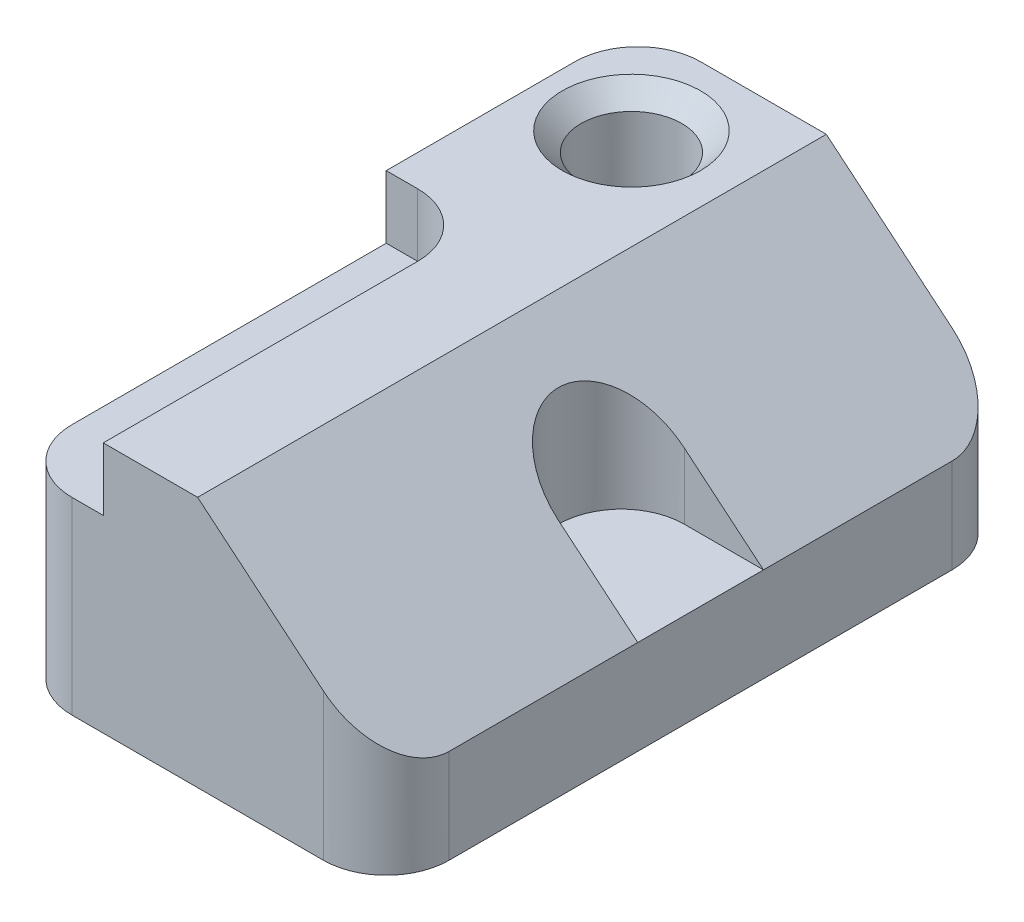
ISO-10303-21;
HEADER;
FILE_DESCRIPTION(('STEP AP214'),'2;1');
FILE_NAME('part.step','',(''),(''),'','','');
FILE_SCHEMA(('AUTOMOTIVE_DESIGN { 1 0 10303 214 1 1 1 1 }'));
ENDSEC;
DATA;
#1=APPLICATION_CONTEXT('core data for automotive mechanical design processes');
#2=APPLICATION_PROTOCOL_DEFINITION('international standard','automotive_design',2000,#1);
#3=PRODUCT_CONTEXT('',#1,'mechanical');
#4=PRODUCT('Part','Part','',(#3));
#5=PRODUCT_RELATED_PRODUCT_CATEGORY('part','',(#4));
#6=PRODUCT_DEFINITION_FORMATION('','',#4);
#7=PRODUCT_DEFINITION_CONTEXT('part definition',#1,'design');
#8=PRODUCT_DEFINITION('design','',#6,#7);
#9=PRODUCT_DEFINITION_SHAPE('','',#8);
#10=(LENGTH_UNIT() NAMED_UNIT(*) SI_UNIT(.MILLI.,.METRE.));
#11=(NAMED_UNIT(*) PLANE_ANGLE_UNIT() SI_UNIT($,.RADIAN.));
#12=(NAMED_UNIT(*) SI_UNIT($,.STERADIAN.) SOLID_ANGLE_UNIT());
#13=UNCERTAINTY_MEASURE_WITH_UNIT(LENGTH_MEASURE(1.E-05),#10,'distance_accuracy_value','');
#14=(GEOMETRIC_REPRESENTATION_CONTEXT(3) GLOBAL_UNCERTAINTY_ASSIGNED_CONTEXT((#13)) GLOBAL_UNIT_ASSIGNED_CONTEXT((#10,
#11,#12)) REPRESENTATION_CONTEXT('',''));
#15=CARTESIAN_POINT('',(0.,0.,0.));
#16=DIRECTION('',(0.,0.,1.));
#17=DIRECTION('',(1.,0.,0.));
#18=AXIS2_PLACEMENT_3D('',#15,#16,#17);
#19=CARTESIAN_POINT('',(0.,50.8,127.));
#20=DIRECTION('',(1.,0.,0.));
#21=DIRECTION('',(0.,1.,0.));
#22=AXIS2_PLACEMENT_3D('',#19,#20,#21);
#23=PLANE('',#22);
#24=DIRECTION('',(0.,0.,-1.));
#25=VECTOR('',#24,1.);
#26=CARTESIAN_POINT('',(0.,50.8,127.));
#27=LINE('',#26,#25);
#28=CARTESIAN_POINT('',(0.,50.8,50.8));
#29=VERTEX_POINT('',#28);
#30=CARTESIAN_POINT('',(0.,50.8,12.7));
#31=VERTEX_POINT('',#30);
#32=EDGE_CURVE('E179',#29,#31,#27,.T.);
#33=ORIENTED_EDGE('',*,*,#32,.T.);
#34=DIRECTION('',(0.,-1.,0.));
#35=VECTOR('',#34,1.);
#36=CARTESIAN_POINT('',(0.,50.8,12.7));
#37=LINE('',#36,#35);
#38=CARTESIAN_POINT('',(0.,0.,12.7));
#39=VERTEX_POINT('',#38);
#40=EDGE_CURVE('E197',#31,#39,#37,.T.);
#41=ORIENTED_EDGE('',*,*,#40,.T.);
#42=DIRECTION('',(0.,0.,-1.));
#43=VECTOR('',#42,1.);
#44=CARTESIAN_POINT('',(0.,0.,127.));
#45=LINE('',#44,#43);
#46=CARTESIAN_POINT('',(0.,0.,114.3));
#47=VERTEX_POINT('',#46);
#48=EDGE_CURVE('E184',#47,#39,#45,.T.);
#49=ORIENTED_EDGE('',*,*,#48,.F.);
#50=DIRECTION('',(0.,-1.,0.));
#51=VECTOR('',#50,1.);
#52=CARTESIAN_POINT('',(0.,38.1,114.3));
#53=LINE('',#52,#51);
#54=CARTESIAN_POINT('',(0.,38.1,114.3));
#55=VERTEX_POINT('',#54);
#56=EDGE_CURVE('E195',#47,#55,#53,.F.);
#57=ORIENTED_EDGE('',*,*,#56,.T.);
#58=DIRECTION('',(0.,0.,1.));
#59=VECTOR('',#58,1.);
#60=CARTESIAN_POINT('',(0.,38.1,127.));
#61=LINE('',#60,#59);
#62=CARTESIAN_POINT('',(0.,38.1,50.8));
#63=VERTEX_POINT('',#62);
#64=EDGE_CURVE('E287',#63,#55,#61,.T.);
#65=ORIENTED_EDGE('',*,*,#64,.F.);
#66=DIRECTION('',(0.,1.,0.));
#67=VECTOR('',#66,1.);
#68=CARTESIAN_POINT('',(0.,38.1,50.8));
#69=LINE('',#68,#67);
#70=EDGE_CURVE('E246',#63,#29,#69,.T.);
#71=ORIENTED_EDGE('',*,*,#70,.T.);
#72=EDGE_LOOP('',(#33,#41,#49,#57,#65,#71));
#73=FACE_BOUND('',#72,.T.);
#74=ADVANCED_FACE('F26',(#73),#23,.F.);
#75=CARTESIAN_POINT('',(0.,0.,127.));
#76=DIRECTION('',(0.,1.,0.));
#77=DIRECTION('',(0.,0.,1.));
#78=AXIS2_PLACEMENT_3D('',#75,#76,#77);
#79=PLANE('',#78);
#80=CARTESIAN_POINT('',(17.78,0.,19.05));
#81=DIRECTION('',(0.,1.,0.));
#82=DIRECTION('',(-1.,0.,0.));
#83=AXIS2_PLACEMENT_3D('',#80,#81,#82);
#84=CIRCLE('',#83,10.16);
#85=CARTESIAN_POINT('',(7.62000000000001,0.,19.05));
#86=VERTEX_POINT('',#85);
#87=EDGE_CURVE('E266',#86,#86,#84,.T.);
#88=ORIENTED_EDGE('',*,*,#87,.T.);
#89=EDGE_LOOP('',(#88));
#90=FACE_BOUND('',#89,.T.);
#91=ORIENTED_EDGE('',*,*,#48,.T.);
#92=CARTESIAN_POINT('',(12.7,0.,12.7));
#93=DIRECTION('',(0.,1.,0.));
#94=DIRECTION('',(0.,0.,1.));
#95=AXIS2_PLACEMENT_3D('',#92,#93,#94);
#96=CIRCLE('',#95,12.7);
#97=CARTESIAN_POINT('',(12.7,0.,0.));
#98=VERTEX_POINT('',#97);
#99=EDGE_CURVE('E206',#39,#98,#96,.F.);
#100=ORIENTED_EDGE('',*,*,#99,.T.);
#101=DIRECTION('',(1.,0.,0.));
#102=VECTOR('',#101,1.);
#103=CARTESIAN_POINT('',(0.,0.,0.));
#104=LINE('',#103,#102);
#105=CARTESIAN_POINT('',(63.5,0.,0.));
#106=VERTEX_POINT('',#105);
#107=EDGE_CURVE('E257',#98,#106,#104,.T.);
#108=ORIENTED_EDGE('',*,*,#107,.T.);
#109=CARTESIAN_POINT('',(63.5,0.,12.7));
#110=DIRECTION('',(0.,1.,0.));
#111=DIRECTION('',(0.,0.,1.));
#112=AXIS2_PLACEMENT_3D('',#109,#110,#111);
#113=CIRCLE('',#112,12.7);
#114=CARTESIAN_POINT('',(76.2,0.,12.7));
#115=VERTEX_POINT('',#114);
#116=EDGE_CURVE('E204',#106,#115,#113,.F.);
#117=ORIENTED_EDGE('',*,*,#116,.T.);
#118=DIRECTION('',(0.,0.,-1.));
#119=VECTOR('',#118,1.);
#120=CARTESIAN_POINT('',(76.2,0.,127.));
#121=LINE('',#120,#119);
#122=CARTESIAN_POINT('',(76.2,0.,114.3));
#123=VERTEX_POINT('',#122);
#124=EDGE_CURVE('E177',#123,#115,#121,.T.);
#125=ORIENTED_EDGE('',*,*,#124,.F.);
#126=CARTESIAN_POINT('',(63.5,0.,114.3));
#127=DIRECTION('',(0.,1.,0.));
#128=DIRECTION('',(0.,0.,1.));
#129=AXIS2_PLACEMENT_3D('',#126,#127,#128);
#130=CIRCLE('',#129,12.7);
#131=CARTESIAN_POINT('',(63.5,0.,127.));
#132=VERTEX_POINT('',#131);
#133=EDGE_CURVE('E202',#123,#132,#130,.F.);
#134=ORIENTED_EDGE('',*,*,#133,.T.);
#135=DIRECTION('',(1.,0.,0.));
#136=VECTOR('',#135,1.);
#137=CARTESIAN_POINT('',(0.,0.,127.));
#138=LINE('',#137,#136);
#139=CARTESIAN_POINT('',(12.7,0.,127.));
#140=VERTEX_POINT('',#139);
#141=EDGE_CURVE('E230',#140,#132,#138,.T.);
#142=ORIENTED_EDGE('',*,*,#141,.F.);
#143=CARTESIAN_POINT('',(12.7,0.,114.3));
#144=DIRECTION('',(0.,1.,0.));
#145=DIRECTION('',(0.,0.,1.));
#146=AXIS2_PLACEMENT_3D('',#143,#144,#145);
#147=CIRCLE('',#146,12.7);
#148=EDGE_CURVE('E200',#140,#47,#147,.F.);
#149=ORIENTED_EDGE('',*,*,#148,.T.);
#150=EDGE_LOOP('',(#91,#100,#108,#117,#125,#134,#142,#149));
#151=FACE_BOUND('',#150,.T.);
#152=ADVANCED_FACE('F256',(#90,#151),#79,.F.);
#153=CARTESIAN_POINT('',(76.2,0.,127.));
#154=DIRECTION('',(-1.,0.,0.));
#155=DIRECTION('',(0.,0.,1.));
#156=AXIS2_PLACEMENT_3D('',#153,#154,#155);
#157=PLANE('',#156);
#158=ORIENTED_EDGE('',*,*,#124,.T.);
#159=DIRECTION('',(0.,1.,0.));
#160=VECTOR('',#159,1.);
#161=CARTESIAN_POINT('',(76.2,0.,12.7));
#162=LINE('',#161,#160);
#163=CARTESIAN_POINT('',(76.2,19.05,12.7));
#164=VERTEX_POINT('',#163);
#165=EDGE_CURVE('E173',#115,#164,#162,.T.);
#166=ORIENTED_EDGE('',*,*,#165,.T.);
#167=DIRECTION('',(0.,0.,-1.));
#168=VECTOR('',#167,1.);
#169=CARTESIAN_POINT('',(76.2,19.05,127.));
#170=LINE('',#169,#168);
#171=CARTESIAN_POINT('',(76.2,19.05,50.8));
#172=VERTEX_POINT('',#171);
#173=EDGE_CURVE('E164',#172,#164,#170,.T.);
#174=ORIENTED_EDGE('',*,*,#173,.F.);
#175=DIRECTION('',(0.,0.,-1.));
#176=VECTOR('',#175,1.);
#177=CARTESIAN_POINT('',(76.2,19.05,50.8));
#178=LINE('',#177,#176);
#179=CARTESIAN_POINT('',(76.2,19.05,76.2));
#180=VERTEX_POINT('',#179);
#181=EDGE_CURVE('E148',#180,#172,#178,.T.);
#182=ORIENTED_EDGE('',*,*,#181,.F.);
#183=CARTESIAN_POINT('',(76.2,19.05,114.3));
#184=VERTEX_POINT('',#183);
#185=EDGE_CURVE('E174',#184,#180,#170,.T.);
#186=ORIENTED_EDGE('',*,*,#185,.F.);
#187=DIRECTION('',(0.,1.,0.));
#188=VECTOR('',#187,1.);
#189=CARTESIAN_POINT('',(76.2,0.,114.3));
#190=LINE('',#189,#188);
#191=EDGE_CURVE('E214',#184,#123,#190,.F.);
#192=ORIENTED_EDGE('',*,*,#191,.T.);
#193=EDGE_LOOP('',(#158,#166,#174,#182,#186,#192));
#194=FACE_BOUND('',#193,.T.);
#195=ADVANCED_FACE('F171',(#194),#157,.F.);
#196=CARTESIAN_POINT('',(76.2,19.05,127.));
#197=DIRECTION('',(-0.64018439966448,-0.768221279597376,0.));
#198=DIRECTION('',(0.768221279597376,-0.64018439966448,0.));
#199=AXIS2_PLACEMENT_3D('',#196,#197,#198);
#200=PLANE('',#199);
#201=ORIENTED_EDGE('',*,*,#173,.T.);
#202=CARTESIAN_POINT('',(63.5,29.6333333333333,12.7));
#203=DIRECTION('',(-0.64018439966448,-0.768221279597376,0.));
#204=DIRECTION('',(-0.768221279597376,0.64018439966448,0.));
#205=AXIS2_PLACEMENT_3D('',#202,#203,#204);
#206=ELLIPSE('',#205,16.5316951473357,12.7);
#207=CARTESIAN_POINT('',(63.5,29.6333333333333,0.));
#208=VERTEX_POINT('',#207);
#209=EDGE_CURVE('E218',#164,#208,#206,.F.);
#210=ORIENTED_EDGE('',*,*,#209,.T.);
#211=DIRECTION('',(-0.768221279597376,0.64018439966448,0.));
#212=VECTOR('',#211,1.);
#213=CARTESIAN_POINT('',(76.2,19.05,0.));
#214=LINE('',#213,#212);
#215=CARTESIAN_POINT('',(38.1,50.8,0.));
#216=VERTEX_POINT('',#215);
#217=EDGE_CURVE('E265',#208,#216,#214,.T.);
#218=ORIENTED_EDGE('',*,*,#217,.T.);
#219=DIRECTION('',(0.,0.,-1.));
#220=VECTOR('',#219,1.);
#221=CARTESIAN_POINT('',(38.1,50.8,127.));
#222=LINE('',#221,#220);
#223=CARTESIAN_POINT('',(38.1,50.8,127.));
#224=VERTEX_POINT('',#223);
#225=EDGE_CURVE('E175',#224,#216,#222,.T.);
#226=ORIENTED_EDGE('',*,*,#225,.F.);
#227=DIRECTION('',(-0.768221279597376,0.64018439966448,0.));
#228=VECTOR('',#227,1.);
#229=CARTESIAN_POINT('',(76.2,19.05,127.));
#230=LINE('',#229,#228);
#231=CARTESIAN_POINT('',(63.5,29.6333333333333,127.));
#232=VERTEX_POINT('',#231);
#233=EDGE_CURVE('E227',#232,#224,#230,.T.);
#234=ORIENTED_EDGE('',*,*,#233,.F.);
#235=CARTESIAN_POINT('',(63.5,29.6333333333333,114.3));
#236=DIRECTION('',(-0.64018439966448,-0.768221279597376,0.));
#237=DIRECTION('',(0.768221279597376,-0.64018439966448,0.));
#238=AXIS2_PLACEMENT_3D('',#235,#236,#237);
#239=ELLIPSE('',#238,16.5316951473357,12.7);
#240=EDGE_CURVE('E46',#232,#184,#239,.F.);
#241=ORIENTED_EDGE('',*,*,#240,.T.);
#242=ORIENTED_EDGE('',*,*,#185,.T.);
#243=DIRECTION('',(-0.768221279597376,0.64018439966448,0.));
#244=VECTOR('',#243,1.);
#245=CARTESIAN_POINT('',(76.2,19.05,76.2));
#246=LINE('',#245,#244);
#247=CARTESIAN_POINT('',(60.198,32.385,76.2));
#248=VERTEX_POINT('',#247);
#249=EDGE_CURVE('E193',#180,#248,#246,.T.);
#250=ORIENTED_EDGE('',*,*,#249,.T.);
#251=CARTESIAN_POINT('',(60.198,32.385,63.5));
#252=DIRECTION('',(-0.64018439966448,-0.768221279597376,0.));
#253=DIRECTION('',(-0.768221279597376,0.64018439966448,0.));
#254=AXIS2_PLACEMENT_3D('',#251,#252,#253);
#255=ELLIPSE('',#254,16.5316951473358,12.7);
#256=CARTESIAN_POINT('',(60.198,32.385,50.8));
#257=VERTEX_POINT('',#256);
#258=EDGE_CURVE('E166',#248,#257,#255,.T.);
#259=ORIENTED_EDGE('',*,*,#258,.T.);
#260=DIRECTION('',(0.768221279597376,-0.64018439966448,0.));
#261=VECTOR('',#260,1.);
#262=CARTESIAN_POINT('',(76.2,19.05,50.8));
#263=LINE('',#262,#261);
#264=EDGE_CURVE('E141',#257,#172,#263,.T.);
#265=ORIENTED_EDGE('',*,*,#264,.T.);
#266=EDGE_LOOP('',(#201,#210,#218,#226,#234,#241,#242,#250,#259,#265));
#267=FACE_BOUND('',#266,.T.);
#268=ADVANCED_FACE('F163',(#267),#200,.F.);
#269=CARTESIAN_POINT('',(38.1,50.8,127.));
#270=DIRECTION('',(0.,-1.,0.));
#271=DIRECTION('',(1.,0.,0.));
#272=AXIS2_PLACEMENT_3D('',#269,#270,#271);
#273=PLANE('',#272);
#274=CARTESIAN_POINT('',(17.78,50.8,19.05));
#275=DIRECTION('',(0.,-1.,0.));
#276=DIRECTION('',(1.,0.,0.));
#277=AXIS2_PLACEMENT_3D('',#274,#275,#276);
#278=CIRCLE('',#277,13.9700000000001);
#279=CARTESIAN_POINT('',(31.7500000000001,50.8,19.05));
#280=VERTEX_POINT('',#279);
#281=EDGE_CURVE('E167',#280,#280,#278,.T.);
#282=ORIENTED_EDGE('',*,*,#281,.T.);
#283=EDGE_LOOP('',(#282));
#284=FACE_BOUND('',#283,.T.);
#285=DIRECTION('',(-1.,0.,0.));
#286=VECTOR('',#285,1.);
#287=CARTESIAN_POINT('',(38.1,50.8,0.));
#288=LINE('',#287,#286);
#289=CARTESIAN_POINT('',(12.7,50.8,0.));
#290=VERTEX_POINT('',#289);
#291=EDGE_CURVE('E236',#216,#290,#288,.T.);
#292=ORIENTED_EDGE('',*,*,#291,.T.);
#293=CARTESIAN_POINT('',(12.7,50.8,12.7));
#294=DIRECTION('',(0.,-1.,0.));
#295=DIRECTION('',(1.,0.,0.));
#296=AXIS2_PLACEMENT_3D('',#293,#294,#295);
#297=CIRCLE('',#296,12.7);
#298=EDGE_CURVE('E212',#290,#31,#297,.F.);
#299=ORIENTED_EDGE('',*,*,#298,.T.);
#300=ORIENTED_EDGE('',*,*,#32,.F.);
#301=DIRECTION('',(-1.,0.,0.));
#302=VECTOR('',#301,1.);
#303=CARTESIAN_POINT('',(0.,50.8,50.8));
#304=LINE('',#303,#302);
#305=CARTESIAN_POINT('',(6.34999999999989,50.8,50.8));
#306=VERTEX_POINT('',#305);
#307=EDGE_CURVE('E291',#306,#29,#304,.T.);
#308=ORIENTED_EDGE('',*,*,#307,.F.);
#309=CARTESIAN_POINT('',(6.34999999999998,50.8,63.5));
#310=DIRECTION('',(0.,1.,0.));
#311=DIRECTION('',(1.,0.,0.));
#312=AXIS2_PLACEMENT_3D('',#309,#310,#311);
#313=CIRCLE('',#312,12.7);
#314=CARTESIAN_POINT('',(19.05,50.8,63.5000000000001));
#315=VERTEX_POINT('',#314);
#316=EDGE_CURVE('E311',#315,#306,#313,.T.);
#317=ORIENTED_EDGE('',*,*,#316,.F.);
#318=DIRECTION('',(0.,0.,-1.));
#319=VECTOR('',#318,1.);
#320=CARTESIAN_POINT('',(19.05,50.8,127.));
#321=LINE('',#320,#319);
#322=CARTESIAN_POINT('',(19.05,50.8,127.));
#323=VERTEX_POINT('',#322);
#324=EDGE_CURVE('E308',#323,#315,#321,.T.);
#325=ORIENTED_EDGE('',*,*,#324,.F.);
#326=DIRECTION('',(-1.,0.,0.));
#327=VECTOR('',#326,1.);
#328=CARTESIAN_POINT('',(38.1,50.8,127.));
#329=LINE('',#328,#327);
#330=EDGE_CURVE('E233',#224,#323,#329,.T.);
#331=ORIENTED_EDGE('',*,*,#330,.F.);
#332=ORIENTED_EDGE('',*,*,#225,.T.);
#333=EDGE_LOOP('',(#292,#299,#300,#308,#317,#325,#331,#332));
#334=FACE_BOUND('',#333,.T.);
#335=ADVANCED_FACE('F272',(#284,#334),#273,.F.);
#336=CARTESIAN_POINT('',(0.,0.,127.));
#337=DIRECTION('',(0.,0.,1.));
#338=DIRECTION('',(1.,0.,0.));
#339=AXIS2_PLACEMENT_3D('',#336,#337,#338);
#340=PLANE('',#339);
#341=ORIENTED_EDGE('',*,*,#141,.T.);
#342=DIRECTION('',(0.,1.,0.));
#343=VECTOR('',#342,1.);
#344=CARTESIAN_POINT('',(63.5,19.05,127.));
#345=LINE('',#344,#343);
#346=EDGE_CURVE('E33',#132,#232,#345,.T.);
#347=ORIENTED_EDGE('',*,*,#346,.T.);
#348=ORIENTED_EDGE('',*,*,#233,.T.);
#349=ORIENTED_EDGE('',*,*,#330,.T.);
#350=DIRECTION('',(0.,1.,0.));
#351=VECTOR('',#350,1.);
#352=CARTESIAN_POINT('',(19.05,38.1,127.));
#353=LINE('',#352,#351);
#354=CARTESIAN_POINT('',(19.05,38.1,127.));
#355=VERTEX_POINT('',#354);
#356=EDGE_CURVE('E283',#355,#323,#353,.T.);
#357=ORIENTED_EDGE('',*,*,#356,.F.);
#358=DIRECTION('',(1.,0.,0.));
#359=VECTOR('',#358,1.);
#360=CARTESIAN_POINT('',(0.,38.1,127.));
#361=LINE('',#360,#359);
#362=CARTESIAN_POINT('',(12.7,38.1,127.));
#363=VERTEX_POINT('',#362);
#364=EDGE_CURVE('E282',#363,#355,#361,.T.);
#365=ORIENTED_EDGE('',*,*,#364,.F.);
#366=DIRECTION('',(0.,-1.,0.));
#367=VECTOR('',#366,1.);
#368=CARTESIAN_POINT('',(12.7,0.,127.));
#369=LINE('',#368,#367);
#370=EDGE_CURVE('E220',#363,#140,#369,.T.);
#371=ORIENTED_EDGE('',*,*,#370,.T.);
#372=EDGE_LOOP('',(#341,#347,#348,#349,#357,#365,#371));
#373=FACE_BOUND('',#372,.T.);
#374=ADVANCED_FACE('F225',(#373),#340,.T.);
#375=CARTESIAN_POINT('',(0.,0.,0.));
#376=DIRECTION('',(0.,0.,1.));
#377=DIRECTION('',(1.,0.,0.));
#378=AXIS2_PLACEMENT_3D('',#375,#376,#377);
#379=PLANE('',#378);
#380=ORIENTED_EDGE('',*,*,#107,.F.);
#381=DIRECTION('',(0.,-1.,0.));
#382=VECTOR('',#381,1.);
#383=CARTESIAN_POINT('',(12.7,0.,0.));
#384=LINE('',#383,#382);
#385=EDGE_CURVE('E210',#98,#290,#384,.F.);
#386=ORIENTED_EDGE('',*,*,#385,.T.);
#387=ORIENTED_EDGE('',*,*,#291,.F.);
#388=ORIENTED_EDGE('',*,*,#217,.F.);
#389=DIRECTION('',(0.,1.,0.));
#390=VECTOR('',#389,1.);
#391=CARTESIAN_POINT('',(63.5,0.,0.));
#392=LINE('',#391,#390);
#393=EDGE_CURVE('E208',#208,#106,#392,.F.);
#394=ORIENTED_EDGE('',*,*,#393,.T.);
#395=EDGE_LOOP('',(#380,#386,#387,#388,#394));
#396=FACE_BOUND('',#395,.T.);
#397=ADVANCED_FACE('F260',(#396),#379,.F.);
#398=CARTESIAN_POINT('',(17.78,0.,19.05));
#399=DIRECTION('',(0.,1.,0.));
#400=DIRECTION('',(-1.,0.,0.));
#401=AXIS2_PLACEMENT_3D('',#398,#399,#400);
#402=CYLINDRICAL_SURFACE('',#401,10.16);
#403=CARTESIAN_POINT('',(17.78,46.99,19.05));
#404=DIRECTION('',(0.,-1.,0.));
#405=DIRECTION('',(1.,0.,0.));
#406=AXIS2_PLACEMENT_3D('',#403,#404,#405);
#407=CIRCLE('',#406,10.16);
#408=CARTESIAN_POINT('',(27.94,46.99,19.05));
#409=VERTEX_POINT('',#408);
#410=EDGE_CURVE('E187',#409,#409,#407,.F.);
#411=ORIENTED_EDGE('',*,*,#410,.T.);
#412=EDGE_LOOP('',(#411));
#413=FACE_BOUND('',#412,.T.);
#414=ORIENTED_EDGE('',*,*,#87,.F.);
#415=EDGE_LOOP('',(#414));
#416=FACE_BOUND('',#415,.T.);
#417=ADVANCED_FACE('F359',(#413,#416),#402,.F.);
#418=CARTESIAN_POINT('',(17.78,46.99,19.05));
#419=DIRECTION('',(0.,1.,0.));
#420=DIRECTION('',(-1.,0.,0.));
#421=AXIS2_PLACEMENT_3D('',#418,#419,#420);
#422=CONICAL_SURFACE('',#421,10.16,0.78539816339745);
#423=ORIENTED_EDGE('',*,*,#281,.F.);
#424=EDGE_LOOP('',(#423));
#425=FACE_BOUND('',#424,.T.);
#426=ORIENTED_EDGE('',*,*,#410,.F.);
#427=EDGE_LOOP('',(#426));
#428=FACE_BOUND('',#427,.T.);
#429=ADVANCED_FACE('F362',(#425,#428),#422,.F.);
#430=CARTESIAN_POINT('',(0.,38.1,50.8));
#431=DIRECTION('',(0.,0.,-1.));
#432=DIRECTION('',(-1.,0.,0.));
#433=AXIS2_PLACEMENT_3D('',#430,#431,#432);
#434=PLANE('',#433);
#435=ORIENTED_EDGE('',*,*,#307,.T.);
#436=ORIENTED_EDGE('',*,*,#70,.F.);
#437=DIRECTION('',(-1.,0.,0.));
#438=VECTOR('',#437,1.);
#439=CARTESIAN_POINT('',(0.,38.1,50.8));
#440=LINE('',#439,#438);
#441=CARTESIAN_POINT('',(6.34999999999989,38.1,50.8));
#442=VERTEX_POINT('',#441);
#443=EDGE_CURVE('E297',#442,#63,#440,.T.);
#444=ORIENTED_EDGE('',*,*,#443,.F.);
#445=DIRECTION('',(0.,1.,0.));
#446=VECTOR('',#445,1.);
#447=CARTESIAN_POINT('',(6.34999999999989,38.1,50.8));
#448=LINE('',#447,#446);
#449=EDGE_CURVE('E301',#442,#306,#448,.T.);
#450=ORIENTED_EDGE('',*,*,#449,.T.);
#451=EDGE_LOOP('',(#435,#436,#444,#450));
#452=FACE_BOUND('',#451,.T.);
#453=ADVANCED_FACE('F319',(#452),#434,.F.);
#454=CARTESIAN_POINT('',(6.34999999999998,38.1,63.5));
#455=DIRECTION('',(0.,1.,0.));
#456=DIRECTION('',(-1.,0.,0.));
#457=AXIS2_PLACEMENT_3D('',#454,#455,#456);
#458=CYLINDRICAL_SURFACE('',#457,12.7);
#459=ORIENTED_EDGE('',*,*,#316,.T.);
#460=ORIENTED_EDGE('',*,*,#449,.F.);
#461=CARTESIAN_POINT('',(6.34999999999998,38.1,63.5));
#462=DIRECTION('',(0.,1.,0.));
#463=DIRECTION('',(1.,0.,0.));
#464=AXIS2_PLACEMENT_3D('',#461,#462,#463);
#465=CIRCLE('',#464,12.7);
#466=CARTESIAN_POINT('',(19.05,38.1,63.5000000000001));
#467=VERTEX_POINT('',#466);
#468=EDGE_CURVE('E289',#467,#442,#465,.T.);
#469=ORIENTED_EDGE('',*,*,#468,.F.);
#470=DIRECTION('',(0.,1.,0.));
#471=VECTOR('',#470,1.);
#472=CARTESIAN_POINT('',(19.05,38.1,63.5000000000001));
#473=LINE('',#472,#471);
#474=EDGE_CURVE('E303',#467,#315,#473,.T.);
#475=ORIENTED_EDGE('',*,*,#474,.T.);
#476=EDGE_LOOP('',(#459,#460,#469,#475));
#477=FACE_BOUND('',#476,.T.);
#478=ADVANCED_FACE('F323',(#477),#458,.F.);
#479=CARTESIAN_POINT('',(19.05,38.1,127.));
#480=DIRECTION('',(1.,0.,0.));
#481=DIRECTION('',(0.,1.,0.));
#482=AXIS2_PLACEMENT_3D('',#479,#480,#481);
#483=PLANE('',#482);
#484=ORIENTED_EDGE('',*,*,#324,.T.);
#485=ORIENTED_EDGE('',*,*,#474,.F.);
#486=DIRECTION('',(0.,0.,-1.));
#487=VECTOR('',#486,1.);
#488=CARTESIAN_POINT('',(19.05,38.1,127.));
#489=LINE('',#488,#487);
#490=EDGE_CURVE('E286',#355,#467,#489,.T.);
#491=ORIENTED_EDGE('',*,*,#490,.F.);
#492=ORIENTED_EDGE('',*,*,#356,.T.);
#493=EDGE_LOOP('',(#484,#485,#491,#492));
#494=FACE_BOUND('',#493,.T.);
#495=ADVANCED_FACE('F307',(#494),#483,.F.);
#496=CARTESIAN_POINT('',(6.34999999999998,38.1,63.5));
#497=DIRECTION('',(0.,-1.,0.));
#498=DIRECTION('',(1.,0.,0.));
#499=AXIS2_PLACEMENT_3D('',#496,#497,#498);
#500=PLANE('',#499);
#501=ORIENTED_EDGE('',*,*,#64,.T.);
#502=CARTESIAN_POINT('',(12.7,38.1,114.3));
#503=DIRECTION('',(0.,-1.,0.));
#504=DIRECTION('',(1.,0.,0.));
#505=AXIS2_PLACEMENT_3D('',#502,#503,#504);
#506=CIRCLE('',#505,12.7);
#507=EDGE_CURVE('E11',#55,#363,#506,.F.);
#508=ORIENTED_EDGE('',*,*,#507,.T.);
#509=ORIENTED_EDGE('',*,*,#364,.T.);
#510=ORIENTED_EDGE('',*,*,#490,.T.);
#511=ORIENTED_EDGE('',*,*,#468,.T.);
#512=ORIENTED_EDGE('',*,*,#443,.T.);
#513=EDGE_LOOP('',(#501,#508,#509,#510,#511,#512));
#514=FACE_BOUND('',#513,.T.);
#515=ADVANCED_FACE('F324',(#514),#500,.F.);
#516=CARTESIAN_POINT('',(76.2,19.05,76.2));
#517=DIRECTION('',(0.,0.,1.));
#518=DIRECTION('',(1.,0.,0.));
#519=AXIS2_PLACEMENT_3D('',#516,#517,#518);
#520=PLANE('',#519);
#521=DIRECTION('',(1.,0.,0.));
#522=VECTOR('',#521,1.);
#523=CARTESIAN_POINT('',(76.2,19.05,76.2));
#524=LINE('',#523,#522);
#525=CARTESIAN_POINT('',(60.198,19.05,76.2));
#526=VERTEX_POINT('',#525);
#527=EDGE_CURVE('E154',#526,#180,#524,.T.);
#528=ORIENTED_EDGE('',*,*,#527,.F.);
#529=DIRECTION('',(0.,1.,0.));
#530=VECTOR('',#529,1.);
#531=CARTESIAN_POINT('',(60.198,19.05,76.2));
#532=LINE('',#531,#530);
#533=EDGE_CURVE('E312',#526,#248,#532,.T.);
#534=ORIENTED_EDGE('',*,*,#533,.T.);
#535=ORIENTED_EDGE('',*,*,#249,.F.);
#536=EDGE_LOOP('',(#528,#534,#535));
#537=FACE_BOUND('',#536,.T.);
#538=ADVANCED_FACE('F326',(#537),#520,.F.);
#539=CARTESIAN_POINT('',(60.198,19.05,63.5));
#540=DIRECTION('',(0.,1.,0.));
#541=DIRECTION('',(-1.,0.,0.));
#542=AXIS2_PLACEMENT_3D('',#539,#540,#541);
#543=CYLINDRICAL_SURFACE('',#542,12.7);
#544=ORIENTED_EDGE('',*,*,#533,.F.);
#545=CARTESIAN_POINT('',(60.198,19.05,63.5));
#546=DIRECTION('',(0.,1.,0.));
#547=DIRECTION('',(1.,0.,0.));
#548=AXIS2_PLACEMENT_3D('',#545,#546,#547);
#549=CIRCLE('',#548,12.7);
#550=CARTESIAN_POINT('',(60.198,19.05,50.8));
#551=VERTEX_POINT('',#550);
#552=EDGE_CURVE('E147',#551,#526,#549,.T.);
#553=ORIENTED_EDGE('',*,*,#552,.F.);
#554=DIRECTION('',(0.,1.,0.));
#555=VECTOR('',#554,1.);
#556=CARTESIAN_POINT('',(60.198,19.05,50.8));
#557=LINE('',#556,#555);
#558=EDGE_CURVE('E143',#551,#257,#557,.T.);
#559=ORIENTED_EDGE('',*,*,#558,.T.);
#560=ORIENTED_EDGE('',*,*,#258,.F.);
#561=EDGE_LOOP('',(#544,#553,#559,#560));
#562=FACE_BOUND('',#561,.T.);
#563=ADVANCED_FACE('F333',(#562),#543,.F.);
#564=CARTESIAN_POINT('',(60.198,19.05,50.8));
#565=DIRECTION('',(0.,0.,-1.));
#566=DIRECTION('',(-1.,0.,0.));
#567=AXIS2_PLACEMENT_3D('',#564,#565,#566);
#568=PLANE('',#567);
#569=ORIENTED_EDGE('',*,*,#558,.F.);
#570=DIRECTION('',(-1.,0.,0.));
#571=VECTOR('',#570,1.);
#572=CARTESIAN_POINT('',(60.198,19.05,50.8));
#573=LINE('',#572,#571);
#574=EDGE_CURVE('E137',#172,#551,#573,.T.);
#575=ORIENTED_EDGE('',*,*,#574,.F.);
#576=ORIENTED_EDGE('',*,*,#264,.F.);
#577=EDGE_LOOP('',(#569,#575,#576));
#578=FACE_BOUND('',#577,.T.);
#579=ADVANCED_FACE('F139',(#578),#568,.F.);
#580=CARTESIAN_POINT('',(60.198,19.05,63.5));
#581=DIRECTION('',(0.,-1.,0.));
#582=DIRECTION('',(1.,0.,0.));
#583=AXIS2_PLACEMENT_3D('',#580,#581,#582);
#584=PLANE('',#583);
#585=ORIENTED_EDGE('',*,*,#181,.T.);
#586=ORIENTED_EDGE('',*,*,#574,.T.);
#587=ORIENTED_EDGE('',*,*,#552,.T.);
#588=ORIENTED_EDGE('',*,*,#527,.T.);
#589=EDGE_LOOP('',(#585,#586,#587,#588));
#590=FACE_BOUND('',#589,.T.);
#591=ADVANCED_FACE('F152',(#590),#584,.F.);
#592=CARTESIAN_POINT('',(12.7,50.8,12.7));
#593=DIRECTION('',(0.,-1.,0.));
#594=DIRECTION('',(1.,0.,0.));
#595=AXIS2_PLACEMENT_3D('',#592,#593,#594);
#596=CYLINDRICAL_SURFACE('',#595,12.7);
#597=ORIENTED_EDGE('',*,*,#298,.F.);
#598=ORIENTED_EDGE('',*,*,#385,.F.);
#599=ORIENTED_EDGE('',*,*,#99,.F.);
#600=ORIENTED_EDGE('',*,*,#40,.F.);
#601=EDGE_LOOP('',(#597,#598,#599,#600));
#602=FACE_BOUND('',#601,.T.);
#603=ADVANCED_FACE('F251',(#602),#596,.T.);
#604=CARTESIAN_POINT('',(63.5,0.,12.7));
#605=DIRECTION('',(0.,1.,0.));
#606=DIRECTION('',(0.,0.,1.));
#607=AXIS2_PLACEMENT_3D('',#604,#605,#606);
#608=CYLINDRICAL_SURFACE('',#607,12.7);
#609=ORIENTED_EDGE('',*,*,#116,.F.);
#610=ORIENTED_EDGE('',*,*,#393,.F.);
#611=ORIENTED_EDGE('',*,*,#209,.F.);
#612=ORIENTED_EDGE('',*,*,#165,.F.);
#613=EDGE_LOOP('',(#609,#610,#611,#612));
#614=FACE_BOUND('',#613,.T.);
#615=ADVANCED_FACE('F274',(#614),#608,.T.);
#616=CARTESIAN_POINT('',(63.5,0.,114.3));
#617=DIRECTION('',(0.,-1.,0.));
#618=DIRECTION('',(0.,0.,-1.));
#619=AXIS2_PLACEMENT_3D('',#616,#617,#618);
#620=CYLINDRICAL_SURFACE('',#619,12.7);
#621=ORIENTED_EDGE('',*,*,#133,.F.);
#622=ORIENTED_EDGE('',*,*,#191,.F.);
#623=ORIENTED_EDGE('',*,*,#240,.F.);
#624=ORIENTED_EDGE('',*,*,#346,.F.);
#625=EDGE_LOOP('',(#621,#622,#623,#624));
#626=FACE_BOUND('',#625,.T.);
#627=ADVANCED_FACE('F276',(#626),#620,.T.);
#628=CARTESIAN_POINT('',(12.7,0.,114.3));
#629=DIRECTION('',(0.,1.,0.));
#630=DIRECTION('',(-1.,0.,0.));
#631=AXIS2_PLACEMENT_3D('',#628,#629,#630);
#632=CYLINDRICAL_SURFACE('',#631,12.7);
#633=ORIENTED_EDGE('',*,*,#507,.F.);
#634=ORIENTED_EDGE('',*,*,#56,.F.);
#635=ORIENTED_EDGE('',*,*,#148,.F.);
#636=ORIENTED_EDGE('',*,*,#370,.F.);
#637=EDGE_LOOP('',(#633,#634,#635,#636));
#638=FACE_BOUND('',#637,.T.);
#639=ADVANCED_FACE('F280',(#638),#632,.T.);
#640=CLOSED_SHELL('',(#74,#152,#195,#268,#335,#374,#397,#417,#429,#453,#478,#495,#515,#538,#563,
#579,#591,#603,#615,#627,#639));
#641=MANIFOLD_SOLID_BREP('B2',#640);
#642=ADVANCED_BREP_SHAPE_REPRESENTATION('',(#18,#641),#14);
#643=SHAPE_DEFINITION_REPRESENTATION(#9,#642);
ENDSEC;
END-ISO-10303-21;
